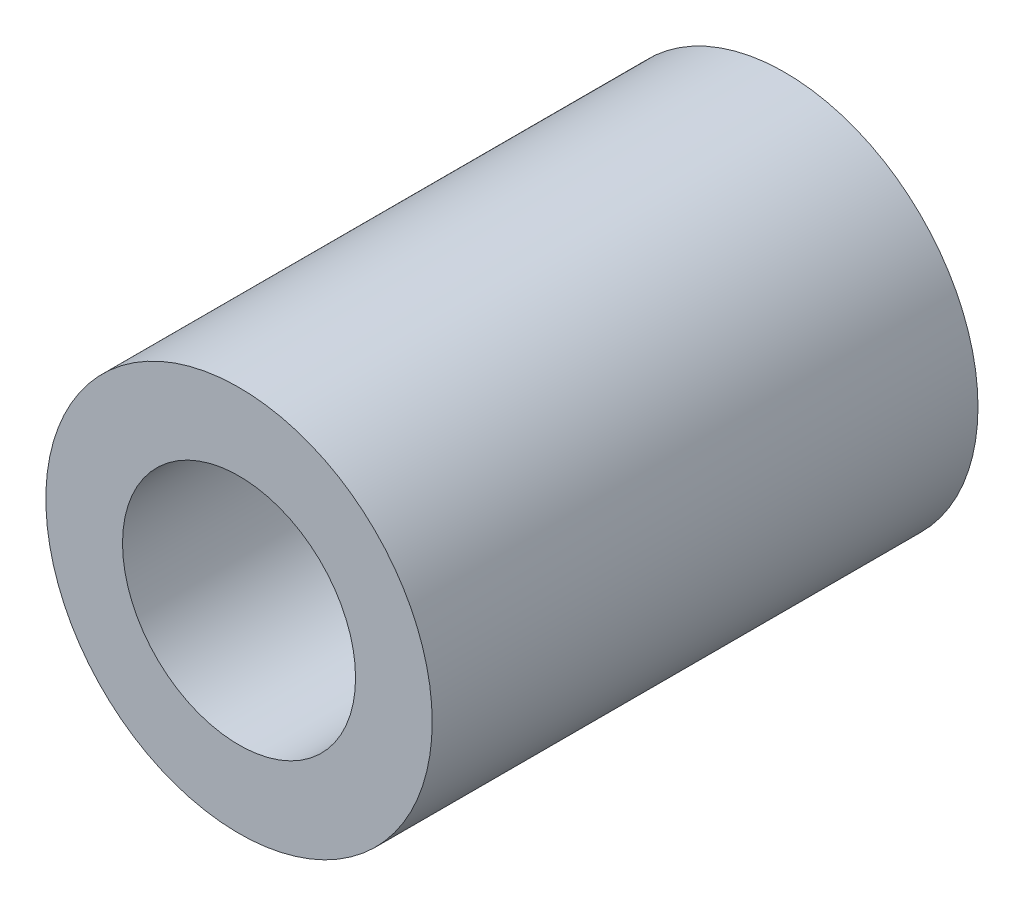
ISO-10303-21;
HEADER;
FILE_DESCRIPTION(('STEP AP214'),'2;1');
FILE_NAME('part.step','',(''),(''),'','','');
FILE_SCHEMA(('AUTOMOTIVE_DESIGN { 1 0 10303 214 1 1 1 1 }'));
ENDSEC;
DATA;
#1=APPLICATION_CONTEXT('core data for automotive mechanical design processes');
#2=APPLICATION_PROTOCOL_DEFINITION('international standard','automotive_design',2000,#1);
#3=PRODUCT_CONTEXT('',#1,'mechanical');
#4=PRODUCT('Part','Part','',(#3));
#5=PRODUCT_RELATED_PRODUCT_CATEGORY('part','',(#4));
#6=PRODUCT_DEFINITION_FORMATION('','',#4);
#7=PRODUCT_DEFINITION_CONTEXT('part definition',#1,'design');
#8=PRODUCT_DEFINITION('design','',#6,#7);
#9=PRODUCT_DEFINITION_SHAPE('','',#8);
#10=(LENGTH_UNIT() NAMED_UNIT(*) SI_UNIT(.MILLI.,.METRE.));
#11=(NAMED_UNIT(*) PLANE_ANGLE_UNIT() SI_UNIT($,.RADIAN.));
#12=(NAMED_UNIT(*) SI_UNIT($,.STERADIAN.) SOLID_ANGLE_UNIT());
#13=UNCERTAINTY_MEASURE_WITH_UNIT(LENGTH_MEASURE(1.E-05),#10,'distance_accuracy_value','');
#14=(GEOMETRIC_REPRESENTATION_CONTEXT(3) GLOBAL_UNCERTAINTY_ASSIGNED_CONTEXT((#13)) GLOBAL_UNIT_ASSIGNED_CONTEXT((#10,
#11,#12)) REPRESENTATION_CONTEXT('',''));
#15=CARTESIAN_POINT('',(0.,0.,0.));
#16=DIRECTION('',(0.,0.,1.));
#17=DIRECTION('',(1.,0.,0.));
#18=AXIS2_PLACEMENT_3D('',#15,#16,#17);
#19=CARTESIAN_POINT('',(0.,0.,89.));
#20=DIRECTION('',(0.,0.,1.));
#21=DIRECTION('',(1.,0.,0.));
#22=AXIS2_PLACEMENT_3D('',#19,#20,#21);
#23=PLANE('',#22);
#24=CARTESIAN_POINT('',(0.,0.,89.));
#25=DIRECTION('',(0.,0.,1.));
#26=DIRECTION('',(1.,0.,0.));
#27=AXIS2_PLACEMENT_3D('',#24,#25,#26);
#28=CIRCLE('',#27,31.5);
#29=CARTESIAN_POINT('',(31.5,0.,89.));
#30=VERTEX_POINT('',#29);
#31=EDGE_CURVE('E9',#30,#30,#28,.T.);
#32=ORIENTED_EDGE('',*,*,#31,.T.);
#33=EDGE_LOOP('',(#32));
#34=FACE_BOUND('',#33,.T.);
#35=CARTESIAN_POINT('',(0.,0.,89.));
#36=DIRECTION('',(0.,0.,1.));
#37=DIRECTION('',(1.,0.,0.));
#38=AXIS2_PLACEMENT_3D('',#35,#36,#37);
#39=CIRCLE('',#38,19.);
#40=CARTESIAN_POINT('',(19.,0.,89.));
#41=VERTEX_POINT('',#40);
#42=EDGE_CURVE('E25',#41,#41,#39,.T.);
#43=ORIENTED_EDGE('',*,*,#42,.F.);
#44=EDGE_LOOP('',(#43));
#45=FACE_BOUND('',#44,.T.);
#46=ADVANCED_FACE('F14',(#34,#45),#23,.T.);
#47=CARTESIAN_POINT('',(0.,0.,0.));
#48=DIRECTION('',(0.,0.,1.));
#49=DIRECTION('',(1.,0.,0.));
#50=AXIS2_PLACEMENT_3D('',#47,#48,#49);
#51=PLANE('',#50);
#52=CARTESIAN_POINT('',(0.,0.,0.));
#53=DIRECTION('',(0.,0.,1.));
#54=DIRECTION('',(1.,0.,0.));
#55=AXIS2_PLACEMENT_3D('',#52,#53,#54);
#56=CIRCLE('',#55,31.5);
#57=CARTESIAN_POINT('',(31.5,0.,0.));
#58=VERTEX_POINT('',#57);
#59=EDGE_CURVE('E18',#58,#58,#56,.T.);
#60=ORIENTED_EDGE('',*,*,#59,.F.);
#61=EDGE_LOOP('',(#60));
#62=FACE_BOUND('',#61,.T.);
#63=CARTESIAN_POINT('',(0.,0.,0.));
#64=DIRECTION('',(0.,0.,1.));
#65=DIRECTION('',(1.,0.,0.));
#66=AXIS2_PLACEMENT_3D('',#63,#64,#65);
#67=CIRCLE('',#66,19.);
#68=CARTESIAN_POINT('',(19.,0.,0.));
#69=VERTEX_POINT('',#68);
#70=EDGE_CURVE('E27',#69,#69,#67,.T.);
#71=ORIENTED_EDGE('',*,*,#70,.T.);
#72=EDGE_LOOP('',(#71));
#73=FACE_BOUND('',#72,.T.);
#74=ADVANCED_FACE('F37',(#62,#73),#51,.F.);
#75=CARTESIAN_POINT('',(0.,0.,89.));
#76=DIRECTION('',(0.,0.,-1.));
#77=DIRECTION('',(-1.,0.,0.));
#78=AXIS2_PLACEMENT_3D('',#75,#76,#77);
#79=CYLINDRICAL_SURFACE('',#78,31.5);
#80=ORIENTED_EDGE('',*,*,#31,.F.);
#81=EDGE_LOOP('',(#80));
#82=FACE_BOUND('',#81,.T.);
#83=ORIENTED_EDGE('',*,*,#59,.T.);
#84=EDGE_LOOP('',(#83));
#85=FACE_BOUND('',#84,.T.);
#86=ADVANCED_FACE('F16',(#82,#85),#79,.T.);
#87=CARTESIAN_POINT('',(0.,0.,89.));
#88=DIRECTION('',(0.,0.,-1.));
#89=DIRECTION('',(-1.,0.,0.));
#90=AXIS2_PLACEMENT_3D('',#87,#88,#89);
#91=CYLINDRICAL_SURFACE('',#90,19.);
#92=ORIENTED_EDGE('',*,*,#42,.T.);
#93=EDGE_LOOP('',(#92));
#94=FACE_BOUND('',#93,.T.);
#95=ORIENTED_EDGE('',*,*,#70,.F.);
#96=EDGE_LOOP('',(#95));
#97=FACE_BOUND('',#96,.T.);
#98=ADVANCED_FACE('F33',(#94,#97),#91,.F.);
#99=CLOSED_SHELL('',(#46,#74,#86,#98));
#100=MANIFOLD_SOLID_BREP('B1',#99);
#101=ADVANCED_BREP_SHAPE_REPRESENTATION('',(#18,#100),#14);
#102=SHAPE_DEFINITION_REPRESENTATION(#9,#101);
ENDSEC;
END-ISO-10303-21;
